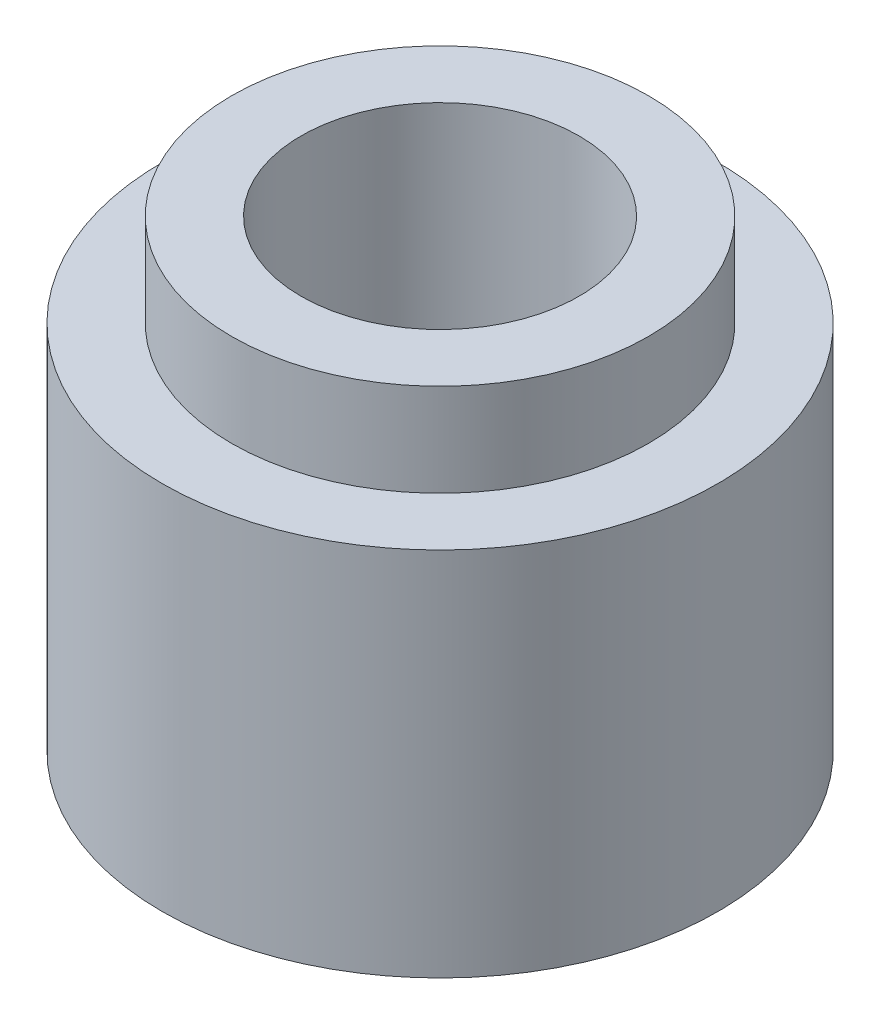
from build123d import *

# Parameters (mm, degrees)
SKETCH_1_R          = 3
EXTRUDE_1_DEPTH     = 4
SKETCH_2_R          = 2.25
EXTRUDE_2_DEPTH     = 1
SKETCH_3_R          = 1.5
CUT_EXTRUDE_1_DEPTH = 5


with BuildPart() as part:
    # Sketch 1 → Extrude 1 (new body)
    with BuildSketch(Plane(origin=(0, 0, 0), x_dir=(1, 0, 0), z_dir=(0, 1, 0))):
        with Locations(Location((0, 0, 0), (0, 0, 270))):
            Circle(SKETCH_1_R)
    extrude(amount=EXTRUDE_1_DEPTH)

    # Sketch 2 → Extrude 2 (add)
    with BuildSketch(Plane(origin=(0, 4, 0), x_dir=(1, 0, 0), z_dir=(0, 1, 0))):
        with Locations(Location((0, 0, 0), (0, 0, 270))):
            Circle(SKETCH_2_R)
    extrude(amount=EXTRUDE_2_DEPTH)

    # Sketch 3 → Cut-Extrude 1 (cut)
    with BuildSketch(Plane.XZ):
        with Locations(Location((0, 0, 0), (0, 0, 270))):
            Circle(SKETCH_3_R)
    extrude(amount=-CUT_EXTRUDE_1_DEPTH, mode=Mode.SUBTRACT)


solid = part.part
